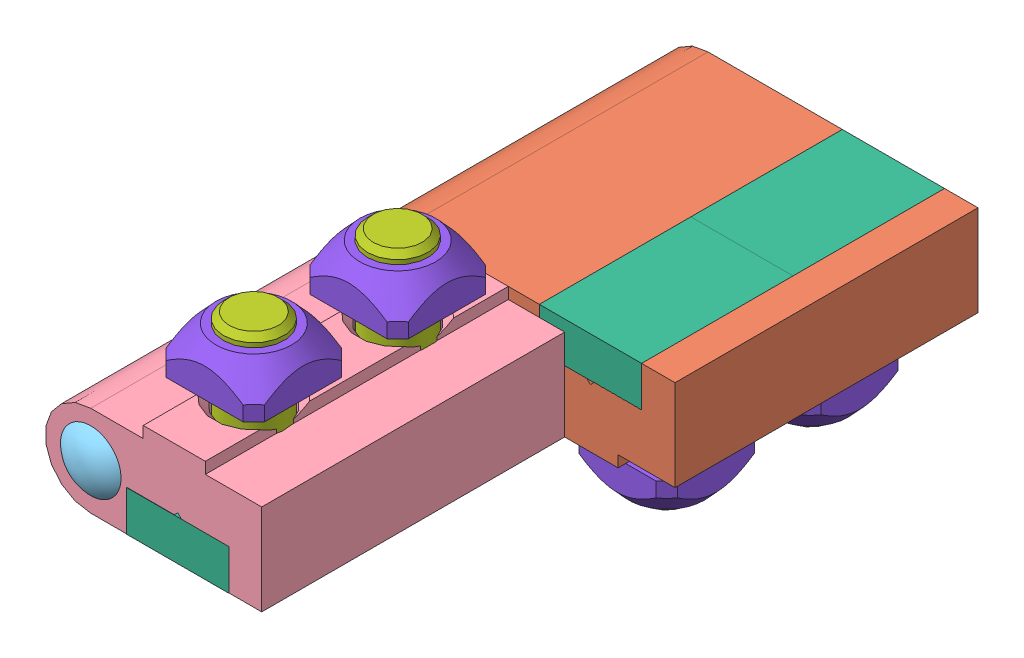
SolidWorks assembly 21.1095 HINGE 32 LEFT HAND.SLDASM, configuration Default (file format 3800). Lengths in mm.
Overall size (41.65 34.68 84.51).
18 component instances, 8 part files, 38 mates.
Components (placement in the parent):
- 21.1096 HINGE PIN-1: 21.1096 HINGE PIN.SLDPRT [Default] at origin size (6.07 6.07 65)
- 21.1096 HINGE 45 AL BLOCK-1: 21.1096 HINGE 45 AL BLOCK.SLDPRT [Default] at (24.5 -6 31.75) size (41.65 13.5 40)
- 21.1096 HINGE WASHER-1: 21.1096 HINGE WASHER.SLDPRT [Default] at (0 0 31.75) size (10 10 1.5)
- 21.1100 HINGE 19 AL BLOCK-1: 21.1100 HINGE 19 AL BLOCK.SLDPRT [Default] at (11.5 6 33.25) x (1 0 0) z (0 0 -1) size (28.58 13.5 40)
- 21.1096 HINGE PIN END CAP-1: 21.1096 HINGE PIN END CAP.SLDPRT [Default] at (0 0 74.75) x (0.967889 -0.251378 0) z (-0.251378 -0.967889 0) size (8 7 8)
- 21.1096 HINGE PIN END CAP-2: 21.1096 HINGE PIN END CAP.SLDPRT [Default] at (0 0 -9.75) x (1 0 0) z (0 1 0) size (8 7 8)
- 22.1050 HINGE SCREW CAP-1: 22.1050 HINGE SCREW CAP.SLDPRT [Default] at (4.7316 -6.0371 63.25) x (0 0 1) z (1 0 0) size (20 5.34 13.5)
- 22.1050 HINGE SCREW CAP-2: 22.1050 HINGE SCREW CAP.SLDPRT [Default] at (4.7316 -6 43.25) x (0 0 1) z (1 0 0) size (20 5.34 13.5)
- 22.1050 HINGE SCREW CAP-3: 22.1050 HINGE SCREW CAP.SLDPRT [Default] at (31.2316 6 1.75) x (0 0 1) z (-1 0 0) size (20 5.34 13.5)
- 22.1050 HINGE SCREW CAP-4: 22.1050 HINGE SCREW CAP.SLDPRT [Default] at (31.2316 6 21.75) x (0 0 1) z (-1 0 0) size (20 5.34 13.5)
- 21.1268 M8X18-1: 21.1268 M8X18.SLDPRT [Default] at (11.0292 -0.6603 62.75) x (0 1 0) z (0 0 1) size (23 13 13)
- 21.1268 M8X18-2: 21.1268 M8X18.SLDPRT [Default] at (11.0292 -0.6603 43.75) x (0 1 0) z (0 0 1) size (23 13 13)
- 21.1268 M8X18-3: 21.1268 M8X18.SLDPRT [Default] at (24.0292 0.6603 2.25) x (0 -1 0) z (0 0 1) size (23 13 13)
- 21.1268 M8X18-4: 21.1268 M8X18.SLDPRT [Default] at (24.0292 0.6603 21.25) x (0 -1 0) z (0 0 1) size (23 13 13)
- 21.1351 M8 SQUARE NUT-1: 21.1351 M8 SQUARE NUT.SLDPRT [Default] at (11.0292 10.5 43.75) x (1 0 0) z (0 -1 0) size (13 13 5.5)
- 21.1351 M8 SQUARE NUT-2: 21.1351 M8 SQUARE NUT.SLDPRT [Default] at (11.0292 10.5 62.75) x (1 0 0) z (0 -1 0) size (13 13 5.5)
- 21.1351 M8 SQUARE NUT-3: 21.1351 M8 SQUARE NUT.SLDPRT [Default] at (24.0292 -10.5 21.25) x (1 0 0) z (0 1 0) size (13 13 5.5)
- 21.1351 M8 SQUARE NUT-4: 21.1351 M8 SQUARE NUT.SLDPRT [Default] at (24.0292 -10.5 2.25) x (1 0 0) z (0 1 0) size (13 13 5.5)
Mates (geometry in assembly coordinates):
- Coincident1: coincident anti-aligned: axis of 21.1096 HINGE PIN-1; axis of 21.1096 HINGE 45 AL BLOCK-1
- Distance1: distance = 33.25 mm aligned: plane of 21.1096 HINGE PIN-1 through (0 0 65) normal (0 0 1); plane of 21.1096 HINGE 45 AL BLOCK-1 through (17.0063 -0.593 31.75) normal (0 0 1)
- Coincident3: coincident aligned: axis of 21.1096 HINGE PIN-1; axis of 21.1096 HINGE WASHER-1
- Coincident4: coincident anti-aligned: plane of 21.1096 HINGE 45 AL BLOCK-1 through (17.0063 -0.593 31.75) normal (0 0 1); plane of 21.1096 HINGE WASHER-1 through (0 0 31.75) normal (0 0 -1)
- Coincident6: coincident aligned: axis of 21.1100 HINGE 19 AL BLOCK-1; axis of 21.1096 HINGE PIN-1
- Coincident7: coincident anti-aligned: plane of 21.1096 HINGE WASHER-1 through (0 0 33.25) normal (0 0 1); plane of 21.1100 HINGE 19 AL BLOCK-1 through (9.7205 0.7653 33.25) normal (0 0 -1)
- Concentric1: concentric anti-aligned: cylinder of 21.1100 HINGE 19 AL BLOCK-1; cylinder of 21.1096 HINGE PIN END CAP-1
- Coincident8: coincident anti-aligned: plane of 21.1100 HINGE 19 AL BLOCK-1 through (9.7205 0.7653 73.25) normal (0 0 1); plane of 21.1096 HINGE PIN END CAP-1 through (3.436 -0.8924 73.25) normal (0 0 -1)
- Coincident11: coincident anti-aligned: plane of 21.1096 HINGE 45 AL BLOCK-1 through (17.0063 -0.593 -8.25) normal (0 0 -1); plane of 21.1096 HINGE PIN END CAP-2 through (3.55 0 -8.25) normal (0 0 1)
- Coincident12: coincident aligned: axis of 21.1096 HINGE 45 AL BLOCK-1; axis of 21.1096 HINGE PIN END CAP-2
- Coincident13: coincident anti-aligned: plane of 22.1050 HINGE SCREW CAP-1 through (4.7316 -0.6971 54.55) normal (0 1 0); plane of 21.1100 HINGE 19 AL BLOCK-1 through (18.2316 -0.6971 33.25) normal (0 -1 0)
- Coincident14: coincident anti-aligned: plane of 21.1100 HINGE 19 AL BLOCK-1 through (4.7316 -0.6603 33.25) normal (1 0 0); plane of 22.1050 HINGE SCREW CAP-1 through (4.7316 -4.4741 63.25) normal (-1 0 0)
- Coincident15: coincident aligned: plane of 21.1100 HINGE 19 AL BLOCK-1 through (9.7205 0.7653 73.25) normal (0 0 1); plane of 22.1050 HINGE SCREW CAP-1 through (4.7316 -6.0371 73.25) normal (0 0 1)
- Coincident16: coincident anti-aligned: plane of 22.1050 HINGE SCREW CAP-1 through (4.7316 -0.6971 53.25) normal (0 0 -1); plane of 22.1050 HINGE SCREW CAP-2 through (4.7316 -6 53.25) normal (0 0 1)
- Coincident17: coincident anti-aligned: plane of 22.1050 HINGE SCREW CAP-2 through (4.7316 -4.4369 43.25) normal (-1 0 0); plane of 21.1100 HINGE 19 AL BLOCK-1 through (4.7316 -0.6603 33.25) normal (1 0 0)
- Coincident18: coincident aligned: plane of 21.1100 HINGE 19 AL BLOCK-1 through (22.575 -6 33.25) normal (0 -1 0); plane of 22.1050 HINGE SCREW CAP-2 through (4.7316 -6 33.25) normal (0 -1 0)
- Coincident19: coincident aligned: plane of 22.1050 HINGE SCREW CAP-3 through (31.2316 0.66 -8.25) normal (0 0 -1); plane of 21.1096 HINGE 45 AL BLOCK-1 through (17.0063 -0.593 -8.25) normal (0 0 -1)
- Coincident20: coincident anti-aligned: plane of 21.1096 HINGE 45 AL BLOCK-1 through (31.2316 6 31.75) normal (-1 0 0); plane of 22.1050 HINGE SCREW CAP-3 through (31.2316 4.4369 1.75) normal (1 0 0)
- Coincident21: coincident aligned: plane of 21.1096 HINGE 45 AL BLOCK-1 through (17.7316 6 31.75) normal (0 1 0); plane of 22.1050 HINGE SCREW CAP-3 through (31.2316 6 -8.25) normal (0 1 0)
- Coincident22: coincident anti-aligned: plane of 22.1050 HINGE SCREW CAP-3 through (31.2316 6 11.75) normal (0 0 1); plane of 22.1050 HINGE SCREW CAP-4 through (31.2316 0.66 11.75) normal (0 0 -1)
- Coincident23: coincident anti-aligned: plane of 21.1096 HINGE 45 AL BLOCK-1 through (17.7316 0.6603 31.75) normal (1 0 0); plane of 22.1050 HINGE SCREW CAP-4 through (17.7316 4.4369 21.75) normal (-1 0 0)
- Coincident24: coincident aligned: plane of 21.1096 HINGE 45 AL BLOCK-1 through (17.7316 6 31.75) normal (0 1 0); plane of 22.1050 HINGE SCREW CAP-4 through (31.2316 6 11.75) normal (0 1 0)
- Coincident25: coincident anti-aligned: axis of 21.1100 HINGE 19 AL BLOCK-1; axis of 21.1268 M8X18-1
- Coincident26: coincident anti-aligned: axis of 21.1100 HINGE 19 AL BLOCK-1; axis of 21.1268 M8X18-2
- Coincident29: coincident anti-aligned: plane of 21.1100 HINGE 19 AL BLOCK-1 through (11 -0.6603 33.25) normal (0 -1 0); plane of 21.1268 M8X18-2 through (5.7792 -0.6603 43.75) normal (0 1 0)
- Coincident30: coincident anti-aligned: plane of 21.1100 HINGE 19 AL BLOCK-1 through (11 -0.6603 33.25) normal (0 -1 0); plane of 21.1268 M8X18-1 through (5.7792 -0.6603 62.75) normal (0 1 0)
- Coincident31: coincident anti-aligned: axis of 21.1096 HINGE 45 AL BLOCK-1; axis of 21.1268 M8X18-3
- Coincident32: coincident anti-aligned: axis of 21.1096 HINGE 45 AL BLOCK-1; axis of 21.1268 M8X18-4
- Coincident33: coincident anti-aligned: plane of 21.1096 HINGE 45 AL BLOCK-1 through (24 0.6603 31.75) normal (0 1 0); plane of 21.1268 M8X18-3 through (29.2792 0.6603 2.25) normal (0 -1 0)
- Coincident34: coincident anti-aligned: plane of 21.1096 HINGE 45 AL BLOCK-1 through (24 0.6603 31.75) normal (0 1 0); plane of 21.1268 M8X18-4 through (29.2792 0.6603 21.25) normal (0 -1 0)
- Coincident35: coincident aligned: axis of 21.1351 M8 SQUARE NUT-4; axis of 21.1268 M8X18-3
- Distance2: distance = 4.5 mm anti-aligned: plane of 21.1351 M8 SQUARE NUT-4 through (24.0292 -10.5 2.25) normal (0 1 0); plane of 21.1096 HINGE 45 AL BLOCK-1 through (0 -6 31.75) normal (0 -1 0)
- Coincident42: coincident aligned: axis of 21.1351 M8 SQUARE NUT-3; axis of 21.1268 M8X18-4
- Distance7: distance = 4.5 mm anti-aligned: plane of 21.1351 M8 SQUARE NUT-3 through (24.0292 -10.5 21.25) normal (0 1 0); plane of 21.1096 HINGE 45 AL BLOCK-1 through (28.1292 -6 31.75) normal (0 -1 0)
- Coincident44: coincident aligned: axis of 21.1351 M8 SQUARE NUT-2; axis of 21.1268 M8X18-1
- Coincident45: coincident aligned: axis of ?; axis of 21.1268 M8X18-2
- Distance8: distance = 4.5 mm anti-aligned: plane of 21.1351 M8 SQUARE NUT-2 through (11.0292 10.5 62.75) normal (0 -1 0); plane of 21.1100 HINGE 19 AL BLOCK-1 through (15.1292 6 33.25) normal (0 1 0)
- Distance9: distance = 4.5 mm anti-aligned: plane of 21.1100 HINGE 19 AL BLOCK-1 through (15.1292 6 33.25) normal (0 1 0); plane of 21.1351 M8 SQUARE NUT-1 through (11.0292 10.5 43.75) normal (0 -1 0)
